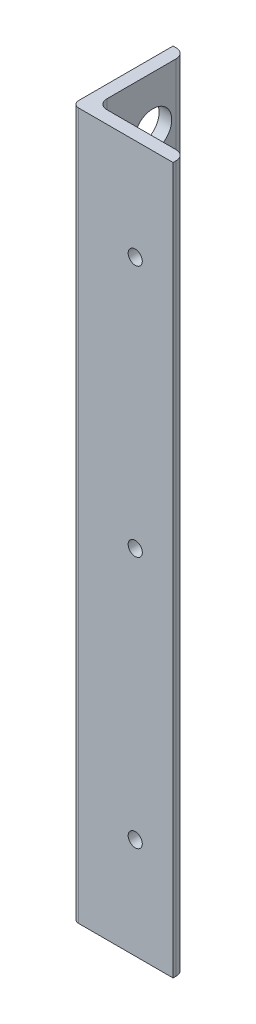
from build123d import *

# Parameters (mm, degrees)
BOSS_EXTRUDE1_DEPTH = 177.8
FILLET1_R           = 2.38125
FILLET2_R           = 1.5875
SKETCH3_R           = 4.7371
CUT_EXTRUDE2_DEPTH  = 181.975
SKETCH4_R           = 1.778
CUT_EXTRUDE3_DEPTH  = 181.975


with BuildPart() as part:
    # Sketch1 → Boss-Extrude1 (new body)
    with BuildSketch(Plane(origin=(0, 0, 0), x_dir=(1, 0, 0), z_dir=(0, 1, 0))):
        Polygon((0, 0), (0, 25.4), (3.175, 25.4), (3.175, 3.175), (25.4, 3.175), (25.4, 0), align=None)
    extrude(amount=BOSS_EXTRUDE1_DEPTH)

    # Fillet1
    fillet1_edges = [part.edges().sort_by_distance(p)[0] for p in [
        (3.175, 88.9, -25.4),
        (3.175, 88.9, -3.175),
        (25.4, 88.9, -3.175),
    ]]
    fillet(fillet1_edges, radius=FILLET1_R)

    # Fillet2
    fillet2_edges = [part.edges().sort_by_distance(p)[0] for p in [
        (0, 88.9, 0),
    ]]
    fillet(fillet2_edges, radius=FILLET2_R)

    # Sketch3 → Cut-Extrude2 (cut, through all)
    with BuildSketch(Plane(origin=(3.175, 0, 0), x_dir=(0, 0, -1), z_dir=(1, 0, 0))):
        with Locations((17.145, 165.1)):
            Circle(SKETCH3_R)
        with Locations((17.145, 114.3)):
            Circle(SKETCH3_R)
        with Locations((17.145, 12.7)):
            Circle(SKETCH3_R)
        with Locations((17.145, 63.5)):
            Circle(SKETCH3_R)
    extrude(amount=-CUT_EXTRUDE2_DEPTH, mode=Mode.SUBTRACT)

    # Sketch4 → Cut-Extrude3 (cut, through all)
    with BuildSketch(Plane(origin=(0, 0, -3.175), x_dir=(-1, 0, 0), z_dir=(0, 0, -1))):
        with Locations((-15.875, 25.4)):
            Circle(SKETCH4_R)
        with Locations((-15.875, 88.9)):
            Circle(SKETCH4_R)
        with Locations((-15.875, 152.4)):
            Circle(SKETCH4_R)
    extrude(amount=-CUT_EXTRUDE3_DEPTH, mode=Mode.SUBTRACT)


solid = part.part
